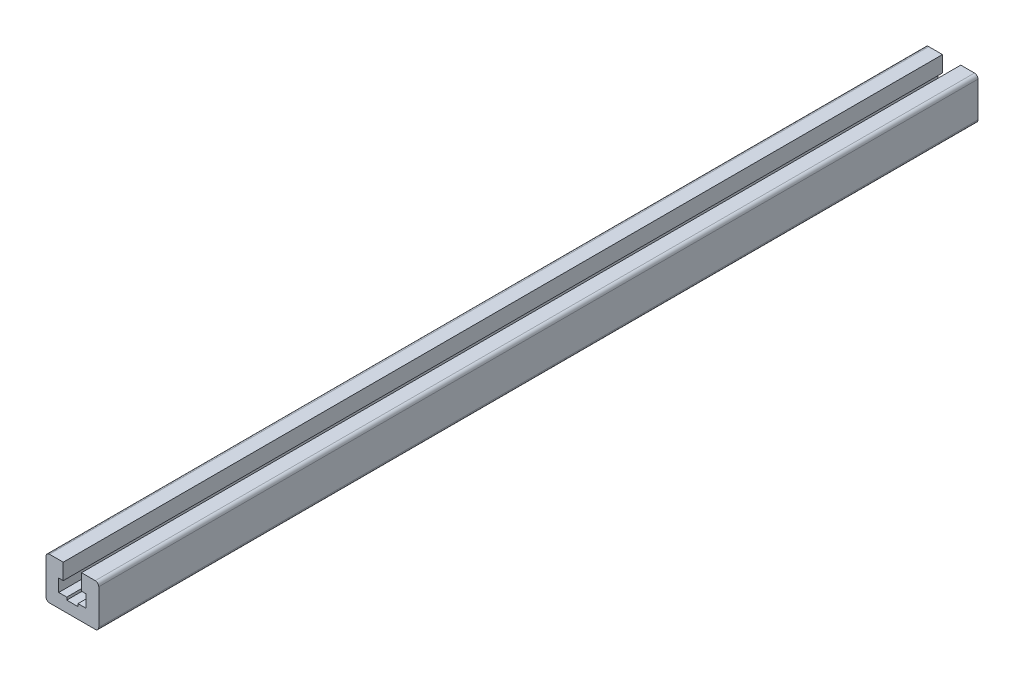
ISO-10303-21;
HEADER;
FILE_DESCRIPTION(('STEP AP214'),'2;1');
FILE_NAME('part.step','',(''),(''),'','','');
FILE_SCHEMA(('AUTOMOTIVE_DESIGN { 1 0 10303 214 1 1 1 1 }'));
ENDSEC;
DATA;
#1=APPLICATION_CONTEXT('core data for automotive mechanical design processes');
#2=APPLICATION_PROTOCOL_DEFINITION('international standard','automotive_design',2000,#1);
#3=PRODUCT_CONTEXT('',#1,'mechanical');
#4=PRODUCT('Part','Part','',(#3));
#5=PRODUCT_RELATED_PRODUCT_CATEGORY('part','',(#4));
#6=PRODUCT_DEFINITION_FORMATION('','',#4);
#7=PRODUCT_DEFINITION_CONTEXT('part definition',#1,'design');
#8=PRODUCT_DEFINITION('design','',#6,#7);
#9=PRODUCT_DEFINITION_SHAPE('','',#8);
#10=(LENGTH_UNIT() NAMED_UNIT(*) SI_UNIT(.MILLI.,.METRE.));
#11=(NAMED_UNIT(*) PLANE_ANGLE_UNIT() SI_UNIT($,.RADIAN.));
#12=(NAMED_UNIT(*) SI_UNIT($,.STERADIAN.) SOLID_ANGLE_UNIT());
#13=UNCERTAINTY_MEASURE_WITH_UNIT(LENGTH_MEASURE(1.E-05),#10,'distance_accuracy_value','');
#14=(GEOMETRIC_REPRESENTATION_CONTEXT(3) GLOBAL_UNCERTAINTY_ASSIGNED_CONTEXT((#13)) GLOBAL_UNIT_ASSIGNED_CONTEXT((#10,
#11,#12)) REPRESENTATION_CONTEXT('',''));
#15=CARTESIAN_POINT('',(0.,0.,0.));
#16=DIRECTION('',(0.,0.,1.));
#17=DIRECTION('',(1.,0.,0.));
#18=AXIS2_PLACEMENT_3D('',#15,#16,#17);
#19=CARTESIAN_POINT('',(-7.75,7.80000000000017,500.));
#20=DIRECTION('',(0.,1.,0.));
#21=DIRECTION('',(0.,0.,-1.));
#22=AXIS2_PLACEMENT_3D('',#19,#20,#21);
#23=PLANE('',#22);
#24=DIRECTION('',(0.,0.,-1.));
#25=VECTOR('',#24,1.);
#26=CARTESIAN_POINT('',(3.2,7.80000000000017,500.));
#27=LINE('',#26,#25);
#28=CARTESIAN_POINT('',(3.2,7.80000000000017,500.));
#29=VERTEX_POINT('',#28);
#30=CARTESIAN_POINT('',(3.2,7.80000000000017,0.));
#31=VERTEX_POINT('',#30);
#32=EDGE_CURVE('E179',#29,#31,#27,.T.);
#33=ORIENTED_EDGE('',*,*,#32,.F.);
#34=DIRECTION('',(1.,0.,0.));
#35=VECTOR('',#34,1.);
#36=CARTESIAN_POINT('',(-7.75,7.80000000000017,500.));
#37=LINE('',#36,#35);
#38=CARTESIAN_POINT('',(7.75,7.80000000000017,500.));
#39=VERTEX_POINT('',#38);
#40=EDGE_CURVE('E168',#29,#39,#37,.T.);
#41=ORIENTED_EDGE('',*,*,#40,.T.);
#42=DIRECTION('',(0.,0.,-1.));
#43=VECTOR('',#42,1.);
#44=CARTESIAN_POINT('',(7.75,7.80000000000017,500.));
#45=LINE('',#44,#43);
#46=CARTESIAN_POINT('',(7.75,7.80000000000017,0.));
#47=VERTEX_POINT('',#46);
#48=EDGE_CURVE('E290',#39,#47,#45,.T.);
#49=ORIENTED_EDGE('',*,*,#48,.T.);
#50=DIRECTION('',(1.,0.,0.));
#51=VECTOR('',#50,1.);
#52=CARTESIAN_POINT('',(-7.75,7.80000000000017,0.));
#53=LINE('',#52,#51);
#54=EDGE_CURVE('E202',#31,#47,#53,.T.);
#55=ORIENTED_EDGE('',*,*,#54,.F.);
#56=EDGE_LOOP('',(#33,#41,#49,#55));
#57=FACE_BOUND('',#56,.T.);
#58=ADVANCED_FACE('F14',(#57),#23,.T.);
#59=CARTESIAN_POINT('',(-13.,2.,500.));
#60=DIRECTION('',(0.,0.,-1.));
#61=DIRECTION('',(-1.,0.,0.));
#62=AXIS2_PLACEMENT_3D('',#59,#60,#61);
#63=CYLINDRICAL_SURFACE('',#62,2.);
#64=DIRECTION('',(0.,0.,-1.));
#65=VECTOR('',#64,1.);
#66=CARTESIAN_POINT('',(-13.,0.,500.));
#67=LINE('',#66,#65);
#68=CARTESIAN_POINT('',(-13.,0.,500.));
#69=VERTEX_POINT('',#68);
#70=CARTESIAN_POINT('',(-13.,0.,0.));
#71=VERTEX_POINT('',#70);
#72=EDGE_CURVE('E22',#69,#71,#67,.T.);
#73=ORIENTED_EDGE('',*,*,#72,.F.);
#74=CARTESIAN_POINT('',(-13.,2.,500.));
#75=DIRECTION('',(0.,0.,-1.));
#76=DIRECTION('',(-1.,0.,0.));
#77=AXIS2_PLACEMENT_3D('',#74,#75,#76);
#78=CIRCLE('',#77,2.);
#79=CARTESIAN_POINT('',(-15.,2.,500.));
#80=VERTEX_POINT('',#79);
#81=EDGE_CURVE('E230',#69,#80,#78,.T.);
#82=ORIENTED_EDGE('',*,*,#81,.T.);
#83=DIRECTION('',(0.,0.,-1.));
#84=VECTOR('',#83,1.);
#85=CARTESIAN_POINT('',(-15.,2.,500.));
#86=LINE('',#85,#84);
#87=CARTESIAN_POINT('',(-15.,2.,0.));
#88=VERTEX_POINT('',#87);
#89=EDGE_CURVE('E276',#80,#88,#86,.T.);
#90=ORIENTED_EDGE('',*,*,#89,.T.);
#91=CARTESIAN_POINT('',(-13.,2.,0.));
#92=DIRECTION('',(0.,0.,-1.));
#93=DIRECTION('',(-1.,0.,0.));
#94=AXIS2_PLACEMENT_3D('',#91,#92,#93);
#95=CIRCLE('',#94,2.);
#96=EDGE_CURVE('E181',#71,#88,#95,.T.);
#97=ORIENTED_EDGE('',*,*,#96,.F.);
#98=EDGE_LOOP('',(#73,#82,#90,#97));
#99=FACE_BOUND('',#98,.T.);
#100=ADVANCED_FACE('F309',(#99),#63,.T.);
#101=CARTESIAN_POINT('',(-13.,0.,500.));
#102=DIRECTION('',(0.,1.,0.));
#103=DIRECTION('',(0.,0.,-1.));
#104=AXIS2_PLACEMENT_3D('',#101,#102,#103);
#105=PLANE('',#104);
#106=DIRECTION('',(0.,0.,-1.));
#107=VECTOR('',#106,1.);
#108=CARTESIAN_POINT('',(13.,0.,500.));
#109=LINE('',#108,#107);
#110=CARTESIAN_POINT('',(13.,0.,500.));
#111=VERTEX_POINT('',#110);
#112=CARTESIAN_POINT('',(13.,0.,0.));
#113=VERTEX_POINT('',#112);
#114=EDGE_CURVE('E305',#111,#113,#109,.T.);
#115=ORIENTED_EDGE('',*,*,#114,.F.);
#116=DIRECTION('',(1.,0.,0.));
#117=VECTOR('',#116,1.);
#118=CARTESIAN_POINT('',(-13.,0.,500.));
#119=LINE('',#118,#117);
#120=EDGE_CURVE('E273',#69,#111,#119,.T.);
#121=ORIENTED_EDGE('',*,*,#120,.F.);
#122=ORIENTED_EDGE('',*,*,#72,.T.);
#123=DIRECTION('',(1.,0.,0.));
#124=VECTOR('',#123,1.);
#125=CARTESIAN_POINT('',(-13.,0.,0.));
#126=LINE('',#125,#124);
#127=EDGE_CURVE('E227',#71,#113,#126,.T.);
#128=ORIENTED_EDGE('',*,*,#127,.T.);
#129=EDGE_LOOP('',(#115,#121,#122,#128));
#130=FACE_BOUND('',#129,.T.);
#131=ADVANCED_FACE('F16',(#130),#105,.F.);
#132=CARTESIAN_POINT('',(13.,2.,500.));
#133=DIRECTION('',(0.,0.,-1.));
#134=DIRECTION('',(-1.,0.,0.));
#135=AXIS2_PLACEMENT_3D('',#132,#133,#134);
#136=CYLINDRICAL_SURFACE('',#135,2.);
#137=DIRECTION('',(0.,0.,-1.));
#138=VECTOR('',#137,1.);
#139=CARTESIAN_POINT('',(15.,2.,500.));
#140=LINE('',#139,#138);
#141=CARTESIAN_POINT('',(15.,2.,500.));
#142=VERTEX_POINT('',#141);
#143=CARTESIAN_POINT('',(15.,2.,0.));
#144=VERTEX_POINT('',#143);
#145=EDGE_CURVE('E303',#142,#144,#140,.T.);
#146=ORIENTED_EDGE('',*,*,#145,.F.);
#147=CARTESIAN_POINT('',(13.,2.,500.));
#148=DIRECTION('',(0.,0.,-1.));
#149=DIRECTION('',(-1.,0.,0.));
#150=AXIS2_PLACEMENT_3D('',#147,#148,#149);
#151=CIRCLE('',#150,2.);
#152=EDGE_CURVE('E270',#142,#111,#151,.T.);
#153=ORIENTED_EDGE('',*,*,#152,.T.);
#154=ORIENTED_EDGE('',*,*,#114,.T.);
#155=CARTESIAN_POINT('',(13.,2.,0.));
#156=DIRECTION('',(0.,0.,-1.));
#157=DIRECTION('',(-1.,0.,0.));
#158=AXIS2_PLACEMENT_3D('',#155,#156,#157);
#159=CIRCLE('',#158,2.);
#160=EDGE_CURVE('E224',#144,#113,#159,.T.);
#161=ORIENTED_EDGE('',*,*,#160,.F.);
#162=EDGE_LOOP('',(#146,#153,#154,#161));
#163=FACE_BOUND('',#162,.T.);
#164=ADVANCED_FACE('F316',(#163),#136,.T.);
#165=CARTESIAN_POINT('',(15.,2.,500.));
#166=DIRECTION('',(-1.,0.,0.));
#167=DIRECTION('',(0.,0.,1.));
#168=AXIS2_PLACEMENT_3D('',#165,#166,#167);
#169=PLANE('',#168);
#170=DIRECTION('',(0.,0.,-1.));
#171=VECTOR('',#170,1.);
#172=CARTESIAN_POINT('',(15.,22.,500.));
#173=LINE('',#172,#171);
#174=CARTESIAN_POINT('',(15.,22.,500.));
#175=VERTEX_POINT('',#174);
#176=CARTESIAN_POINT('',(15.,22.,0.));
#177=VERTEX_POINT('',#176);
#178=EDGE_CURVE('E301',#175,#177,#173,.T.);
#179=ORIENTED_EDGE('',*,*,#178,.F.);
#180=DIRECTION('',(0.,1.,0.));
#181=VECTOR('',#180,1.);
#182=CARTESIAN_POINT('',(15.,2.,500.));
#183=LINE('',#182,#181);
#184=EDGE_CURVE('E267',#142,#175,#183,.T.);
#185=ORIENTED_EDGE('',*,*,#184,.F.);
#186=ORIENTED_EDGE('',*,*,#145,.T.);
#187=DIRECTION('',(0.,1.,0.));
#188=VECTOR('',#187,1.);
#189=CARTESIAN_POINT('',(15.,2.,0.));
#190=LINE('',#189,#188);
#191=EDGE_CURVE('E221',#144,#177,#190,.T.);
#192=ORIENTED_EDGE('',*,*,#191,.T.);
#193=EDGE_LOOP('',(#179,#185,#186,#192));
#194=FACE_BOUND('',#193,.T.);
#195=ADVANCED_FACE('F394',(#194),#169,.F.);
#196=CARTESIAN_POINT('',(13.,22.,500.));
#197=DIRECTION('',(0.,0.,-1.));
#198=DIRECTION('',(-1.,0.,0.));
#199=AXIS2_PLACEMENT_3D('',#196,#197,#198);
#200=CYLINDRICAL_SURFACE('',#199,2.);
#201=DIRECTION('',(0.,0.,-1.));
#202=VECTOR('',#201,1.);
#203=CARTESIAN_POINT('',(13.,24.,500.));
#204=LINE('',#203,#202);
#205=CARTESIAN_POINT('',(13.,24.,500.));
#206=VERTEX_POINT('',#205);
#207=CARTESIAN_POINT('',(13.,24.,0.));
#208=VERTEX_POINT('',#207);
#209=EDGE_CURVE('E299',#206,#208,#204,.T.);
#210=ORIENTED_EDGE('',*,*,#209,.F.);
#211=CARTESIAN_POINT('',(13.,22.,500.));
#212=DIRECTION('',(0.,0.,-1.));
#213=DIRECTION('',(-1.,0.,0.));
#214=AXIS2_PLACEMENT_3D('',#211,#212,#213);
#215=CIRCLE('',#214,2.);
#216=EDGE_CURVE('E264',#206,#175,#215,.T.);
#217=ORIENTED_EDGE('',*,*,#216,.T.);
#218=ORIENTED_EDGE('',*,*,#178,.T.);
#219=CARTESIAN_POINT('',(13.,22.,0.));
#220=DIRECTION('',(0.,0.,-1.));
#221=DIRECTION('',(-1.,0.,0.));
#222=AXIS2_PLACEMENT_3D('',#219,#220,#221);
#223=CIRCLE('',#222,2.);
#224=EDGE_CURVE('E218',#208,#177,#223,.T.);
#225=ORIENTED_EDGE('',*,*,#224,.F.);
#226=EDGE_LOOP('',(#210,#217,#218,#225));
#227=FACE_BOUND('',#226,.T.);
#228=ADVANCED_FACE('F390',(#227),#200,.T.);
#229=CARTESIAN_POINT('',(5.2,24.,500.));
#230=DIRECTION('',(0.,1.,0.));
#231=DIRECTION('',(1.,0.,0.));
#232=AXIS2_PLACEMENT_3D('',#229,#230,#231);
#233=PLANE('',#232);
#234=DIRECTION('',(0.,0.,-1.));
#235=VECTOR('',#234,1.);
#236=CARTESIAN_POINT('',(5.2,24.,500.));
#237=LINE('',#236,#235);
#238=CARTESIAN_POINT('',(5.2,24.,500.));
#239=VERTEX_POINT('',#238);
#240=CARTESIAN_POINT('',(5.2,24.,0.));
#241=VERTEX_POINT('',#240);
#242=EDGE_CURVE('E297',#239,#241,#237,.T.);
#243=ORIENTED_EDGE('',*,*,#242,.F.);
#244=DIRECTION('',(1.,0.,0.));
#245=VECTOR('',#244,1.);
#246=CARTESIAN_POINT('',(5.2,24.,500.));
#247=LINE('',#246,#245);
#248=EDGE_CURVE('E261',#239,#206,#247,.T.);
#249=ORIENTED_EDGE('',*,*,#248,.T.);
#250=ORIENTED_EDGE('',*,*,#209,.T.);
#251=DIRECTION('',(1.,0.,0.));
#252=VECTOR('',#251,1.);
#253=CARTESIAN_POINT('',(5.2,24.,0.));
#254=LINE('',#253,#252);
#255=EDGE_CURVE('E215',#241,#208,#254,.T.);
#256=ORIENTED_EDGE('',*,*,#255,.F.);
#257=EDGE_LOOP('',(#243,#249,#250,#256));
#258=FACE_BOUND('',#257,.T.);
#259=ADVANCED_FACE('F386',(#258),#233,.T.);
#260=CARTESIAN_POINT('',(5.2,24.,500.));
#261=DIRECTION('',(1.,0.,0.));
#262=DIRECTION('',(0.,-1.,0.));
#263=AXIS2_PLACEMENT_3D('',#260,#261,#262);
#264=PLANE('',#263);
#265=DIRECTION('',(0.,0.,-1.));
#266=VECTOR('',#265,1.);
#267=CARTESIAN_POINT('',(5.20000000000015,14.9000000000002,500.));
#268=LINE('',#267,#266);
#269=CARTESIAN_POINT('',(5.20000000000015,14.9000000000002,500.));
#270=VERTEX_POINT('',#269);
#271=CARTESIAN_POINT('',(5.20000000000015,14.9000000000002,0.));
#272=VERTEX_POINT('',#271);
#273=EDGE_CURVE('E295',#270,#272,#268,.T.);
#274=ORIENTED_EDGE('',*,*,#273,.F.);
#275=DIRECTION('',(0.,-1.,0.));
#276=VECTOR('',#275,1.);
#277=CARTESIAN_POINT('',(5.2,24.,500.));
#278=LINE('',#277,#276);
#279=EDGE_CURVE('E258',#239,#270,#278,.T.);
#280=ORIENTED_EDGE('',*,*,#279,.F.);
#281=ORIENTED_EDGE('',*,*,#242,.T.);
#282=DIRECTION('',(0.,-1.,0.));
#283=VECTOR('',#282,1.);
#284=CARTESIAN_POINT('',(5.2,24.,0.));
#285=LINE('',#284,#283);
#286=EDGE_CURVE('E212',#241,#272,#285,.T.);
#287=ORIENTED_EDGE('',*,*,#286,.T.);
#288=EDGE_LOOP('',(#274,#280,#281,#287));
#289=FACE_BOUND('',#288,.T.);
#290=ADVANCED_FACE('F379',(#289),#264,.F.);
#291=CARTESIAN_POINT('',(5.20000000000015,14.9000000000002,500.));
#292=DIRECTION('',(0.,1.,0.));
#293=DIRECTION('',(0.,0.,-1.));
#294=AXIS2_PLACEMENT_3D('',#291,#292,#293);
#295=PLANE('',#294);
#296=DIRECTION('',(0.,0.,-1.));
#297=VECTOR('',#296,1.);
#298=CARTESIAN_POINT('',(7.75,14.9000000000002,500.));
#299=LINE('',#298,#297);
#300=CARTESIAN_POINT('',(7.75,14.9000000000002,500.));
#301=VERTEX_POINT('',#300);
#302=CARTESIAN_POINT('',(7.75,14.9000000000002,0.));
#303=VERTEX_POINT('',#302);
#304=EDGE_CURVE('E293',#301,#303,#299,.T.);
#305=ORIENTED_EDGE('',*,*,#304,.F.);
#306=DIRECTION('',(1.,0.,0.));
#307=VECTOR('',#306,1.);
#308=CARTESIAN_POINT('',(5.20000000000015,14.9000000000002,500.));
#309=LINE('',#308,#307);
#310=EDGE_CURVE('E255',#270,#301,#309,.T.);
#311=ORIENTED_EDGE('',*,*,#310,.F.);
#312=ORIENTED_EDGE('',*,*,#273,.T.);
#313=DIRECTION('',(1.,0.,0.));
#314=VECTOR('',#313,1.);
#315=CARTESIAN_POINT('',(5.20000000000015,14.9000000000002,0.));
#316=LINE('',#315,#314);
#317=EDGE_CURVE('E209',#272,#303,#316,.T.);
#318=ORIENTED_EDGE('',*,*,#317,.T.);
#319=EDGE_LOOP('',(#305,#311,#312,#318));
#320=FACE_BOUND('',#319,.T.);
#321=ADVANCED_FACE('F374',(#320),#295,.F.);
#322=CARTESIAN_POINT('',(7.75,14.9000000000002,500.));
#323=DIRECTION('',(1.,0.,0.));
#324=DIRECTION('',(0.,0.,-1.));
#325=AXIS2_PLACEMENT_3D('',#322,#323,#324);
#326=PLANE('',#325);
#327=ORIENTED_EDGE('',*,*,#48,.F.);
#328=DIRECTION('',(0.,-1.,0.));
#329=VECTOR('',#328,1.);
#330=CARTESIAN_POINT('',(7.75,14.9000000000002,500.));
#331=LINE('',#330,#329);
#332=EDGE_CURVE('E253',#301,#39,#331,.T.);
#333=ORIENTED_EDGE('',*,*,#332,.F.);
#334=ORIENTED_EDGE('',*,*,#304,.T.);
#335=DIRECTION('',(0.,-1.,0.));
#336=VECTOR('',#335,1.);
#337=CARTESIAN_POINT('',(7.75,14.9000000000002,0.));
#338=LINE('',#337,#336);
#339=EDGE_CURVE('E206',#303,#47,#338,.T.);
#340=ORIENTED_EDGE('',*,*,#339,.T.);
#341=EDGE_LOOP('',(#327,#333,#334,#340));
#342=FACE_BOUND('',#341,.T.);
#343=ADVANCED_FACE('F369',(#342),#326,.F.);
#344=DIRECTION('',(0.,0.,1.));
#345=VECTOR('',#344,1.);
#346=CARTESIAN_POINT('',(-3.2,7.80000000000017,500.));
#347=LINE('',#346,#345);
#348=CARTESIAN_POINT('',(-3.2,7.80000000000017,0.));
#349=VERTEX_POINT('',#348);
#350=CARTESIAN_POINT('',(-3.2,7.80000000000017,500.));
#351=VERTEX_POINT('',#350);
#352=EDGE_CURVE('E176',#349,#351,#347,.T.);
#353=ORIENTED_EDGE('',*,*,#352,.F.);
#354=CARTESIAN_POINT('',(-7.75,7.80000000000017,0.));
#355=VERTEX_POINT('',#354);
#356=EDGE_CURVE('E203',#355,#349,#53,.T.);
#357=ORIENTED_EDGE('',*,*,#356,.F.);
#358=DIRECTION('',(0.,0.,-1.));
#359=VECTOR('',#358,1.);
#360=CARTESIAN_POINT('',(-7.75,7.80000000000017,500.));
#361=LINE('',#360,#359);
#362=CARTESIAN_POINT('',(-7.75,7.80000000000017,500.));
#363=VERTEX_POINT('',#362);
#364=EDGE_CURVE('E288',#363,#355,#361,.T.);
#365=ORIENTED_EDGE('',*,*,#364,.F.);
#366=EDGE_CURVE('E250',#363,#351,#37,.T.);
#367=ORIENTED_EDGE('',*,*,#366,.T.);
#368=EDGE_LOOP('',(#353,#357,#365,#367));
#369=FACE_BOUND('',#368,.T.);
#370=ADVANCED_FACE('F346',(#369),#23,.T.);
#371=CARTESIAN_POINT('',(-7.75,14.9000000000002,500.));
#372=DIRECTION('',(1.,0.,0.));
#373=DIRECTION('',(0.,0.,-1.));
#374=AXIS2_PLACEMENT_3D('',#371,#372,#373);
#375=PLANE('',#374);
#376=DIRECTION('',(0.,0.,-1.));
#377=VECTOR('',#376,1.);
#378=CARTESIAN_POINT('',(-7.75,14.9000000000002,500.));
#379=LINE('',#378,#377);
#380=CARTESIAN_POINT('',(-7.75,14.9000000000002,500.));
#381=VERTEX_POINT('',#380);
#382=CARTESIAN_POINT('',(-7.75,14.9000000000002,0.));
#383=VERTEX_POINT('',#382);
#384=EDGE_CURVE('E286',#381,#383,#379,.T.);
#385=ORIENTED_EDGE('',*,*,#384,.F.);
#386=DIRECTION('',(0.,-1.,0.));
#387=VECTOR('',#386,1.);
#388=CARTESIAN_POINT('',(-7.75,14.9000000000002,500.));
#389=LINE('',#388,#387);
#390=EDGE_CURVE('E247',#381,#363,#389,.T.);
#391=ORIENTED_EDGE('',*,*,#390,.T.);
#392=ORIENTED_EDGE('',*,*,#364,.T.);
#393=DIRECTION('',(0.,-1.,0.));
#394=VECTOR('',#393,1.);
#395=CARTESIAN_POINT('',(-7.75,14.9000000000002,0.));
#396=LINE('',#395,#394);
#397=EDGE_CURVE('E199',#383,#355,#396,.T.);
#398=ORIENTED_EDGE('',*,*,#397,.F.);
#399=EDGE_LOOP('',(#385,#391,#392,#398));
#400=FACE_BOUND('',#399,.T.);
#401=ADVANCED_FACE('F342',(#400),#375,.T.);
#402=CARTESIAN_POINT('',(-5.19999999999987,14.9000000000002,500.));
#403=DIRECTION('',(0.,-1.,0.));
#404=DIRECTION('',(-1.,0.,0.));
#405=AXIS2_PLACEMENT_3D('',#402,#403,#404);
#406=PLANE('',#405);
#407=DIRECTION('',(0.,0.,-1.));
#408=VECTOR('',#407,1.);
#409=CARTESIAN_POINT('',(-5.19999999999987,14.9000000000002,500.));
#410=LINE('',#409,#408);
#411=CARTESIAN_POINT('',(-5.19999999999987,14.9000000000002,500.));
#412=VERTEX_POINT('',#411);
#413=CARTESIAN_POINT('',(-5.19999999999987,14.9000000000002,0.));
#414=VERTEX_POINT('',#413);
#415=EDGE_CURVE('E284',#412,#414,#410,.T.);
#416=ORIENTED_EDGE('',*,*,#415,.F.);
#417=DIRECTION('',(-1.,0.,0.));
#418=VECTOR('',#417,1.);
#419=CARTESIAN_POINT('',(-5.19999999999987,14.9000000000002,500.));
#420=LINE('',#419,#418);
#421=EDGE_CURVE('E244',#412,#381,#420,.T.);
#422=ORIENTED_EDGE('',*,*,#421,.T.);
#423=ORIENTED_EDGE('',*,*,#384,.T.);
#424=DIRECTION('',(-1.,0.,0.));
#425=VECTOR('',#424,1.);
#426=CARTESIAN_POINT('',(-5.19999999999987,14.9000000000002,0.));
#427=LINE('',#426,#425);
#428=EDGE_CURVE('E196',#414,#383,#427,.T.);
#429=ORIENTED_EDGE('',*,*,#428,.F.);
#430=EDGE_LOOP('',(#416,#422,#423,#429));
#431=FACE_BOUND('',#430,.T.);
#432=ADVANCED_FACE('F337',(#431),#406,.T.);
#433=CARTESIAN_POINT('',(-5.19999999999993,24.,500.));
#434=DIRECTION('',(1.,0.,0.));
#435=DIRECTION('',(0.,-1.,0.));
#436=AXIS2_PLACEMENT_3D('',#433,#434,#435);
#437=PLANE('',#436);
#438=DIRECTION('',(0.,0.,-1.));
#439=VECTOR('',#438,1.);
#440=CARTESIAN_POINT('',(-5.19999999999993,24.,500.));
#441=LINE('',#440,#439);
#442=CARTESIAN_POINT('',(-5.19999999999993,24.,500.));
#443=VERTEX_POINT('',#442);
#444=CARTESIAN_POINT('',(-5.19999999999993,24.,0.));
#445=VERTEX_POINT('',#444);
#446=EDGE_CURVE('E282',#443,#445,#441,.T.);
#447=ORIENTED_EDGE('',*,*,#446,.F.);
#448=DIRECTION('',(0.,-1.,0.));
#449=VECTOR('',#448,1.);
#450=CARTESIAN_POINT('',(-5.19999999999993,24.,500.));
#451=LINE('',#450,#449);
#452=EDGE_CURVE('E241',#443,#412,#451,.T.);
#453=ORIENTED_EDGE('',*,*,#452,.T.);
#454=ORIENTED_EDGE('',*,*,#415,.T.);
#455=DIRECTION('',(0.,-1.,0.));
#456=VECTOR('',#455,1.);
#457=CARTESIAN_POINT('',(-5.19999999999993,24.,0.));
#458=LINE('',#457,#456);
#459=EDGE_CURVE('E193',#445,#414,#458,.T.);
#460=ORIENTED_EDGE('',*,*,#459,.F.);
#461=EDGE_LOOP('',(#447,#453,#454,#460));
#462=FACE_BOUND('',#461,.T.);
#463=ADVANCED_FACE('F334',(#462),#437,.T.);
#464=CARTESIAN_POINT('',(-13.,24.,500.));
#465=DIRECTION('',(0.,1.,0.));
#466=DIRECTION('',(1.,0.,0.));
#467=AXIS2_PLACEMENT_3D('',#464,#465,#466);
#468=PLANE('',#467);
#469=DIRECTION('',(0.,0.,-1.));
#470=VECTOR('',#469,1.);
#471=CARTESIAN_POINT('',(-13.,24.,500.));
#472=LINE('',#471,#470);
#473=CARTESIAN_POINT('',(-13.,24.,500.));
#474=VERTEX_POINT('',#473);
#475=CARTESIAN_POINT('',(-13.,24.,0.));
#476=VERTEX_POINT('',#475);
#477=EDGE_CURVE('E280',#474,#476,#472,.T.);
#478=ORIENTED_EDGE('',*,*,#477,.F.);
#479=DIRECTION('',(1.,0.,0.));
#480=VECTOR('',#479,1.);
#481=CARTESIAN_POINT('',(-13.,24.,500.));
#482=LINE('',#481,#480);
#483=EDGE_CURVE('E238',#474,#443,#482,.T.);
#484=ORIENTED_EDGE('',*,*,#483,.T.);
#485=ORIENTED_EDGE('',*,*,#446,.T.);
#486=DIRECTION('',(1.,0.,0.));
#487=VECTOR('',#486,1.);
#488=CARTESIAN_POINT('',(-13.,24.,0.));
#489=LINE('',#488,#487);
#490=EDGE_CURVE('E190',#476,#445,#489,.T.);
#491=ORIENTED_EDGE('',*,*,#490,.F.);
#492=EDGE_LOOP('',(#478,#484,#485,#491));
#493=FACE_BOUND('',#492,.T.);
#494=ADVANCED_FACE('F329',(#493),#468,.T.);
#495=CARTESIAN_POINT('',(-13.,22.,500.));
#496=DIRECTION('',(0.,0.,-1.));
#497=DIRECTION('',(-1.,0.,0.));
#498=AXIS2_PLACEMENT_3D('',#495,#496,#497);
#499=CYLINDRICAL_SURFACE('',#498,2.);
#500=DIRECTION('',(0.,0.,-1.));
#501=VECTOR('',#500,1.);
#502=CARTESIAN_POINT('',(-15.,22.,500.));
#503=LINE('',#502,#501);
#504=CARTESIAN_POINT('',(-15.,22.,500.));
#505=VERTEX_POINT('',#504);
#506=CARTESIAN_POINT('',(-15.,22.,0.));
#507=VERTEX_POINT('',#506);
#508=EDGE_CURVE('E278',#505,#507,#503,.T.);
#509=ORIENTED_EDGE('',*,*,#508,.F.);
#510=CARTESIAN_POINT('',(-13.,22.,500.));
#511=DIRECTION('',(0.,0.,-1.));
#512=DIRECTION('',(-1.,0.,0.));
#513=AXIS2_PLACEMENT_3D('',#510,#511,#512);
#514=CIRCLE('',#513,2.);
#515=EDGE_CURVE('E235',#505,#474,#514,.T.);
#516=ORIENTED_EDGE('',*,*,#515,.T.);
#517=ORIENTED_EDGE('',*,*,#477,.T.);
#518=CARTESIAN_POINT('',(-13.,22.,0.));
#519=DIRECTION('',(0.,0.,-1.));
#520=DIRECTION('',(-1.,0.,0.));
#521=AXIS2_PLACEMENT_3D('',#518,#519,#520);
#522=CIRCLE('',#521,2.);
#523=EDGE_CURVE('E187',#507,#476,#522,.T.);
#524=ORIENTED_EDGE('',*,*,#523,.F.);
#525=EDGE_LOOP('',(#509,#516,#517,#524));
#526=FACE_BOUND('',#525,.T.);
#527=ADVANCED_FACE('F327',(#526),#499,.T.);
#528=CARTESIAN_POINT('',(-15.,2.,500.));
#529=DIRECTION('',(-1.,0.,0.));
#530=DIRECTION('',(0.,0.,1.));
#531=AXIS2_PLACEMENT_3D('',#528,#529,#530);
#532=PLANE('',#531);
#533=DIRECTION('',(0.,1.,0.));
#534=VECTOR('',#533,1.);
#535=CARTESIAN_POINT('',(-15.,2.,500.));
#536=LINE('',#535,#534);
#537=EDGE_CURVE('E232',#80,#505,#536,.T.);
#538=ORIENTED_EDGE('',*,*,#537,.T.);
#539=ORIENTED_EDGE('',*,*,#508,.T.);
#540=DIRECTION('',(0.,1.,0.));
#541=VECTOR('',#540,1.);
#542=CARTESIAN_POINT('',(-15.,2.,0.));
#543=LINE('',#542,#541);
#544=EDGE_CURVE('E184',#88,#507,#543,.T.);
#545=ORIENTED_EDGE('',*,*,#544,.F.);
#546=ORIENTED_EDGE('',*,*,#89,.F.);
#547=EDGE_LOOP('',(#538,#539,#545,#546));
#548=FACE_BOUND('',#547,.T.);
#549=ADVANCED_FACE('F323',(#548),#532,.T.);
#550=CARTESIAN_POINT('',(-13.,2.,500.));
#551=DIRECTION('',(0.,0.,-1.));
#552=DIRECTION('',(-1.,0.,0.));
#553=AXIS2_PLACEMENT_3D('',#550,#551,#552);
#554=PLANE('',#553);
#555=ORIENTED_EDGE('',*,*,#40,.F.);
#556=DIRECTION('',(0.,-1.,0.));
#557=VECTOR('',#556,1.);
#558=CARTESIAN_POINT('',(3.2,11.8749339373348,500.));
#559=LINE('',#558,#557);
#560=CARTESIAN_POINT('',(3.2,6.3,500.));
#561=VERTEX_POINT('',#560);
#562=EDGE_CURVE('E151',#29,#561,#559,.T.);
#563=ORIENTED_EDGE('',*,*,#562,.T.);
#564=DIRECTION('',(-1.,0.,0.));
#565=VECTOR('',#564,1.);
#566=CARTESIAN_POINT('',(3.2,6.3,500.));
#567=LINE('',#566,#565);
#568=CARTESIAN_POINT('',(-3.2,6.3,500.));
#569=VERTEX_POINT('',#568);
#570=EDGE_CURVE('E159',#561,#569,#567,.T.);
#571=ORIENTED_EDGE('',*,*,#570,.T.);
#572=DIRECTION('',(0.,1.,0.));
#573=VECTOR('',#572,1.);
#574=CARTESIAN_POINT('',(-3.2,11.8749339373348,500.));
#575=LINE('',#574,#573);
#576=EDGE_CURVE('E156',#569,#351,#575,.T.);
#577=ORIENTED_EDGE('',*,*,#576,.T.);
#578=ORIENTED_EDGE('',*,*,#366,.F.);
#579=ORIENTED_EDGE('',*,*,#390,.F.);
#580=ORIENTED_EDGE('',*,*,#421,.F.);
#581=ORIENTED_EDGE('',*,*,#452,.F.);
#582=ORIENTED_EDGE('',*,*,#483,.F.);
#583=ORIENTED_EDGE('',*,*,#515,.F.);
#584=ORIENTED_EDGE('',*,*,#537,.F.);
#585=ORIENTED_EDGE('',*,*,#81,.F.);
#586=ORIENTED_EDGE('',*,*,#120,.T.);
#587=ORIENTED_EDGE('',*,*,#152,.F.);
#588=ORIENTED_EDGE('',*,*,#184,.T.);
#589=ORIENTED_EDGE('',*,*,#216,.F.);
#590=ORIENTED_EDGE('',*,*,#248,.F.);
#591=ORIENTED_EDGE('',*,*,#279,.T.);
#592=ORIENTED_EDGE('',*,*,#310,.T.);
#593=ORIENTED_EDGE('',*,*,#332,.T.);
#594=EDGE_LOOP('',(#555,#563,#571,#577,#578,#579,#580,#581,#582,#583,#584,#585,#586,#587,#588,
#589,#590,#591,#592,#593));
#595=FACE_BOUND('',#594,.T.);
#596=ADVANCED_FACE('F166',(#595),#554,.F.);
#597=CARTESIAN_POINT('',(-13.,2.,0.));
#598=DIRECTION('',(0.,0.,-1.));
#599=DIRECTION('',(-1.,0.,0.));
#600=AXIS2_PLACEMENT_3D('',#597,#598,#599);
#601=PLANE('',#600);
#602=DIRECTION('',(0.,-1.,0.));
#603=VECTOR('',#602,1.);
#604=CARTESIAN_POINT('',(3.2,2.,0.));
#605=LINE('',#604,#603);
#606=CARTESIAN_POINT('',(3.2,6.3,0.));
#607=VERTEX_POINT('',#606);
#608=EDGE_CURVE('E9',#31,#607,#605,.T.);
#609=ORIENTED_EDGE('',*,*,#608,.F.);
#610=ORIENTED_EDGE('',*,*,#54,.T.);
#611=ORIENTED_EDGE('',*,*,#339,.F.);
#612=ORIENTED_EDGE('',*,*,#317,.F.);
#613=ORIENTED_EDGE('',*,*,#286,.F.);
#614=ORIENTED_EDGE('',*,*,#255,.T.);
#615=ORIENTED_EDGE('',*,*,#224,.T.);
#616=ORIENTED_EDGE('',*,*,#191,.F.);
#617=ORIENTED_EDGE('',*,*,#160,.T.);
#618=ORIENTED_EDGE('',*,*,#127,.F.);
#619=ORIENTED_EDGE('',*,*,#96,.T.);
#620=ORIENTED_EDGE('',*,*,#544,.T.);
#621=ORIENTED_EDGE('',*,*,#523,.T.);
#622=ORIENTED_EDGE('',*,*,#490,.T.);
#623=ORIENTED_EDGE('',*,*,#459,.T.);
#624=ORIENTED_EDGE('',*,*,#428,.T.);
#625=ORIENTED_EDGE('',*,*,#397,.T.);
#626=ORIENTED_EDGE('',*,*,#356,.T.);
#627=DIRECTION('',(0.,1.,0.));
#628=VECTOR('',#627,1.);
#629=CARTESIAN_POINT('',(-3.2,11.8749339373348,0.));
#630=LINE('',#629,#628);
#631=CARTESIAN_POINT('',(-3.2,6.3,0.));
#632=VERTEX_POINT('',#631);
#633=EDGE_CURVE('E169',#632,#349,#630,.T.);
#634=ORIENTED_EDGE('',*,*,#633,.F.);
#635=DIRECTION('',(-1.,0.,0.));
#636=VECTOR('',#635,1.);
#637=CARTESIAN_POINT('',(3.2,6.3,0.));
#638=LINE('',#637,#636);
#639=EDGE_CURVE('E171',#607,#632,#638,.T.);
#640=ORIENTED_EDGE('',*,*,#639,.F.);
#641=EDGE_LOOP('',(#609,#610,#611,#612,#613,#614,#615,#616,#617,#618,#619,#620,#621,#622,#623,
#624,#625,#626,#634,#640));
#642=FACE_BOUND('',#641,.T.);
#643=ADVANCED_FACE('F312',(#642),#601,.T.);
#644=CARTESIAN_POINT('',(3.2,11.8749339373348,500.));
#645=DIRECTION('',(1.,0.,0.));
#646=DIRECTION('',(0.,1.,0.));
#647=AXIS2_PLACEMENT_3D('',#644,#645,#646);
#648=PLANE('',#647);
#649=ORIENTED_EDGE('',*,*,#32,.T.);
#650=ORIENTED_EDGE('',*,*,#608,.T.);
#651=DIRECTION('',(0.,0.,-1.));
#652=VECTOR('',#651,1.);
#653=CARTESIAN_POINT('',(3.2,6.3,500.));
#654=LINE('',#653,#652);
#655=EDGE_CURVE('E29',#561,#607,#654,.T.);
#656=ORIENTED_EDGE('',*,*,#655,.F.);
#657=ORIENTED_EDGE('',*,*,#562,.F.);
#658=EDGE_LOOP('',(#649,#650,#656,#657));
#659=FACE_BOUND('',#658,.T.);
#660=ADVANCED_FACE('F149',(#659),#648,.F.);
#661=CARTESIAN_POINT('',(-3.2,11.8749339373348,500.));
#662=DIRECTION('',(-1.,0.,0.));
#663=DIRECTION('',(0.,-1.,0.));
#664=AXIS2_PLACEMENT_3D('',#661,#662,#663);
#665=PLANE('',#664);
#666=ORIENTED_EDGE('',*,*,#352,.T.);
#667=ORIENTED_EDGE('',*,*,#576,.F.);
#668=DIRECTION('',(0.,0.,-1.));
#669=VECTOR('',#668,1.);
#670=CARTESIAN_POINT('',(-3.2,6.3,500.));
#671=LINE('',#670,#669);
#672=EDGE_CURVE('E155',#569,#632,#671,.T.);
#673=ORIENTED_EDGE('',*,*,#672,.T.);
#674=ORIENTED_EDGE('',*,*,#633,.T.);
#675=EDGE_LOOP('',(#666,#667,#673,#674));
#676=FACE_BOUND('',#675,.T.);
#677=ADVANCED_FACE('F349',(#676),#665,.F.);
#678=CARTESIAN_POINT('',(3.2,6.3,500.));
#679=DIRECTION('',(0.,-1.,0.));
#680=DIRECTION('',(0.,0.,-1.));
#681=AXIS2_PLACEMENT_3D('',#678,#679,#680);
#682=PLANE('',#681);
#683=ORIENTED_EDGE('',*,*,#639,.T.);
#684=ORIENTED_EDGE('',*,*,#672,.F.);
#685=ORIENTED_EDGE('',*,*,#570,.F.);
#686=ORIENTED_EDGE('',*,*,#655,.T.);
#687=EDGE_LOOP('',(#683,#684,#685,#686));
#688=FACE_BOUND('',#687,.T.);
#689=ADVANCED_FACE('F160',(#688),#682,.F.);
#690=CLOSED_SHELL('',(#58,#100,#131,#164,#195,#228,#259,#290,#321,#343,#370,#401,#432,#463,#494,
#527,#549,#596,#643,#660,#677,#689));
#691=MANIFOLD_SOLID_BREP('B1',#690);
#692=ADVANCED_BREP_SHAPE_REPRESENTATION('',(#18,#691),#14);
#693=SHAPE_DEFINITION_REPRESENTATION(#9,#692);
ENDSEC;
END-ISO-10303-21;
